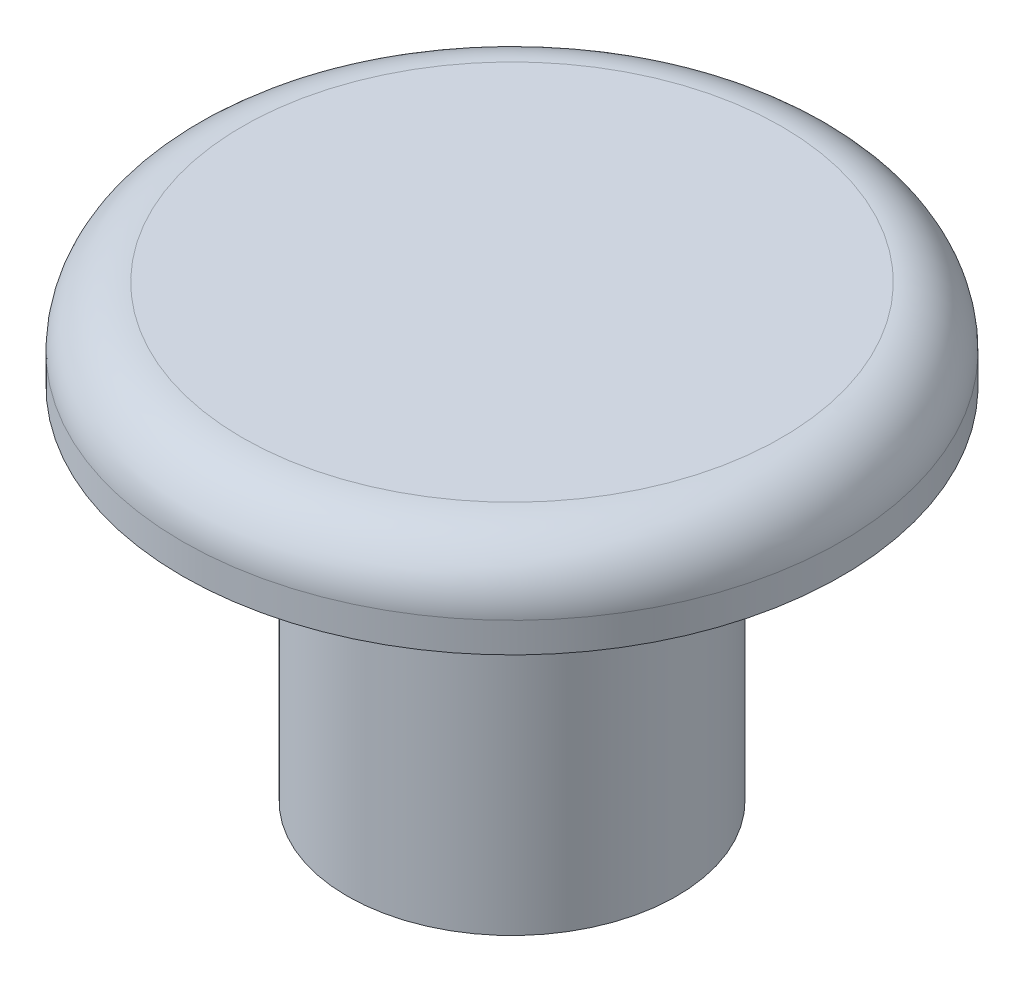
from build123d import *


with BuildPart() as part:
    # Sketch1 → Revolve1 (revolve)
    with BuildSketch(Plane.XY, mode=Mode.PRIVATE) as revolve1_sk:
        with BuildLine():
            Line((0, 0), (0, 15))
            Line((0, 15), (9, 15))
            ThreePointArc((9, 15), (10.414213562, 14.414213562), (11, 13))
            Line((11, 13), (11, 12))
            Line((11, 12), (5.5, 12))
            Line((5.5, 12), (5.5, 0))
            Line((5.5, 0), (0, 0))
        make_face()
    revolve(revolve1_sk.sketch.rotate(Axis((0, 0, 0), (0, -1, 0)), 90), axis=Axis((0, 0, 0), (0, -1, 0)))


solid = part.part
